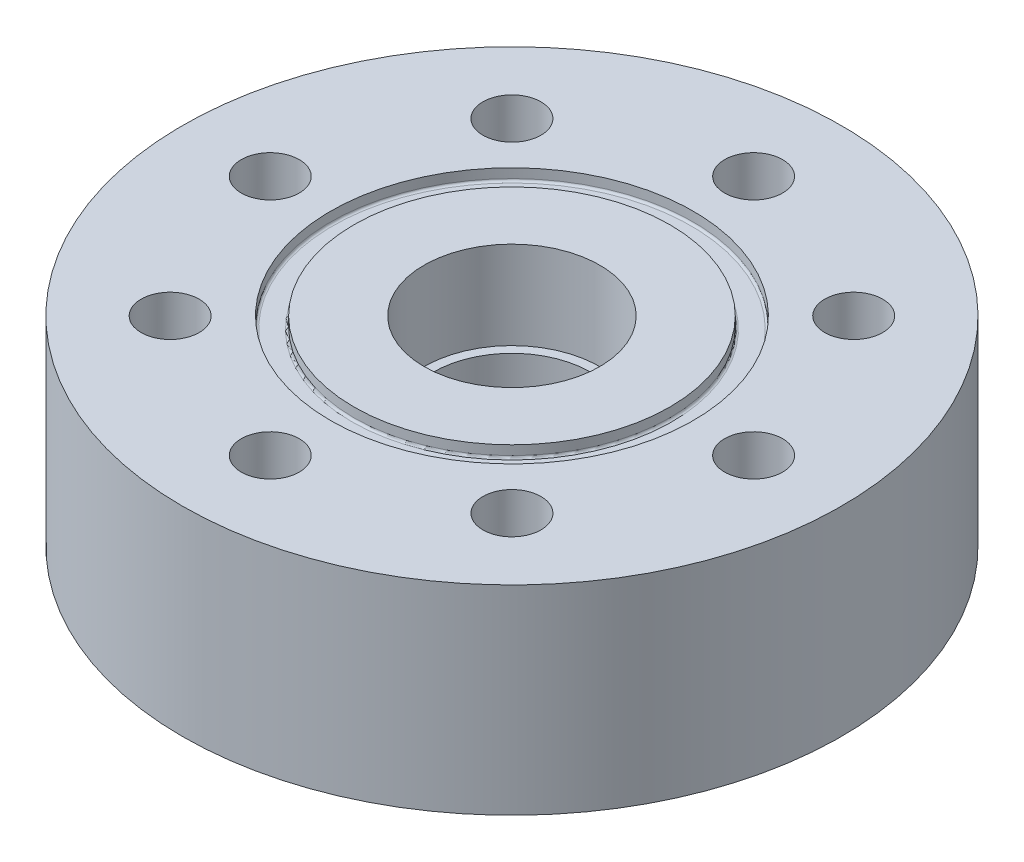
ISO-10303-21;
HEADER;
FILE_DESCRIPTION(('STEP AP214'),'2;1');
FILE_NAME('part.step','',(''),(''),'','','');
FILE_SCHEMA(('AUTOMOTIVE_DESIGN { 1 0 10303 214 1 1 1 1 }'));
ENDSEC;
DATA;
#1=APPLICATION_CONTEXT('core data for automotive mechanical design processes');
#2=APPLICATION_PROTOCOL_DEFINITION('international standard','automotive_design',2000,#1);
#3=PRODUCT_CONTEXT('',#1,'mechanical');
#4=PRODUCT('Part','Part','',(#3));
#5=PRODUCT_RELATED_PRODUCT_CATEGORY('part','',(#4));
#6=PRODUCT_DEFINITION_FORMATION('','',#4);
#7=PRODUCT_DEFINITION_CONTEXT('part definition',#1,'design');
#8=PRODUCT_DEFINITION('design','',#6,#7);
#9=PRODUCT_DEFINITION_SHAPE('','',#8);
#10=(LENGTH_UNIT() NAMED_UNIT(*) SI_UNIT(.MILLI.,.METRE.));
#11=(NAMED_UNIT(*) PLANE_ANGLE_UNIT() SI_UNIT($,.RADIAN.));
#12=(NAMED_UNIT(*) SI_UNIT($,.STERADIAN.) SOLID_ANGLE_UNIT());
#13=UNCERTAINTY_MEASURE_WITH_UNIT(LENGTH_MEASURE(1.E-05),#10,'distance_accuracy_value','');
#14=(GEOMETRIC_REPRESENTATION_CONTEXT(3) GLOBAL_UNCERTAINTY_ASSIGNED_CONTEXT((#13)) GLOBAL_UNIT_ASSIGNED_CONTEXT((#10,
#11,#12)) REPRESENTATION_CONTEXT('',''));
#15=CARTESIAN_POINT('',(0.,0.,0.));
#16=DIRECTION('',(0.,0.,1.));
#17=DIRECTION('',(1.,0.,0.));
#18=AXIS2_PLACEMENT_3D('',#15,#16,#17);
#19=CARTESIAN_POINT('',(0.,22.7,0.));
#20=DIRECTION('',(0.,-1.,0.));
#21=DIRECTION('',(0.,0.,-1.));
#22=AXIS2_PLACEMENT_3D('',#19,#20,#21);
#23=CYLINDRICAL_SURFACE('',#22,37.5);
#24=CARTESIAN_POINT('',(0.,22.7,0.));
#25=DIRECTION('',(0.,1.,0.));
#26=DIRECTION('',(0.,0.,1.));
#27=AXIS2_PLACEMENT_3D('',#24,#25,#26);
#28=CIRCLE('',#27,37.5);
#29=CARTESIAN_POINT('',(0.,22.7,37.5));
#30=VERTEX_POINT('',#29);
#31=EDGE_CURVE('E54',#30,#30,#28,.T.);
#32=ORIENTED_EDGE('',*,*,#31,.F.);
#33=EDGE_LOOP('',(#32));
#34=FACE_BOUND('',#33,.T.);
#35=CARTESIAN_POINT('',(0.,0.,0.));
#36=DIRECTION('',(0.,1.,0.));
#37=DIRECTION('',(0.,0.,1.));
#38=AXIS2_PLACEMENT_3D('',#35,#36,#37);
#39=CIRCLE('',#38,37.5);
#40=CARTESIAN_POINT('',(0.,0.,37.5));
#41=VERTEX_POINT('',#40);
#42=EDGE_CURVE('E55',#41,#41,#39,.T.);
#43=ORIENTED_EDGE('',*,*,#42,.T.);
#44=EDGE_LOOP('',(#43));
#45=FACE_BOUND('',#44,.T.);
#46=ADVANCED_FACE('F34',(#34,#45),#23,.T.);
#47=CARTESIAN_POINT('',(0.,22.7,0.));
#48=DIRECTION('',(0.,1.,0.));
#49=DIRECTION('',(0.,0.,1.));
#50=AXIS2_PLACEMENT_3D('',#47,#48,#49);
#51=PLANE('',#50);
#52=CARTESIAN_POINT('',(0.,22.7,0.));
#53=DIRECTION('',(0.,1.,0.));
#54=DIRECTION('',(0.,0.,1.));
#55=AXIS2_PLACEMENT_3D('',#52,#53,#54);
#56=CIRCLE('',#55,20.6375);
#57=CARTESIAN_POINT('',(0.,22.7,20.6375));
#58=VERTEX_POINT('',#57);
#59=EDGE_CURVE('E73',#58,#58,#56,.T.);
#60=ORIENTED_EDGE('',*,*,#59,.F.);
#61=EDGE_LOOP('',(#60));
#62=FACE_BOUND('',#61,.T.);
#63=CARTESIAN_POINT('',(-27.5,22.7,0.));
#64=DIRECTION('',(0.,-1.,0.));
#65=DIRECTION('',(0.,0.,-1.));
#66=AXIS2_PLACEMENT_3D('',#63,#64,#65);
#67=CIRCLE('',#66,3.3);
#68=CARTESIAN_POINT('',(-27.5,22.7,-3.3));
#69=VERTEX_POINT('',#68);
#70=EDGE_CURVE('E63',#69,#69,#67,.T.);
#71=ORIENTED_EDGE('',*,*,#70,.T.);
#72=EDGE_LOOP('',(#71));
#73=FACE_BOUND('',#72,.T.);
#74=CARTESIAN_POINT('',(-19.44543648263,22.7,19.4454364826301));
#75=DIRECTION('',(0.,-1.,0.));
#76=DIRECTION('',(0.,0.,-1.));
#77=AXIS2_PLACEMENT_3D('',#74,#75,#76);
#78=CIRCLE('',#77,3.30000000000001);
#79=CARTESIAN_POINT('',(-19.44543648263,22.7,16.1454364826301));
#80=VERTEX_POINT('',#79);
#81=EDGE_CURVE('E109',#80,#80,#78,.T.);
#82=ORIENTED_EDGE('',*,*,#81,.T.);
#83=EDGE_LOOP('',(#82));
#84=FACE_BOUND('',#83,.T.);
#85=CARTESIAN_POINT('',(0.,22.7,27.5));
#86=DIRECTION('',(0.,-1.,0.));
#87=DIRECTION('',(0.,0.,-1.));
#88=AXIS2_PLACEMENT_3D('',#85,#86,#87);
#89=CIRCLE('',#88,3.3);
#90=CARTESIAN_POINT('',(0.,22.7,24.2));
#91=VERTEX_POINT('',#90);
#92=EDGE_CURVE('E103',#91,#91,#89,.T.);
#93=ORIENTED_EDGE('',*,*,#92,.T.);
#94=EDGE_LOOP('',(#93));
#95=FACE_BOUND('',#94,.T.);
#96=CARTESIAN_POINT('',(19.4454364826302,22.7,19.44543648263));
#97=DIRECTION('',(0.,-1.,0.));
#98=DIRECTION('',(0.,0.,-1.));
#99=AXIS2_PLACEMENT_3D('',#96,#97,#98);
#100=CIRCLE('',#99,3.3);
#101=CARTESIAN_POINT('',(19.4454364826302,22.7,16.14543648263));
#102=VERTEX_POINT('',#101);
#103=EDGE_CURVE('E97',#102,#102,#100,.T.);
#104=ORIENTED_EDGE('',*,*,#103,.T.);
#105=EDGE_LOOP('',(#104));
#106=FACE_BOUND('',#105,.T.);
#107=CARTESIAN_POINT('',(27.5,22.7,-1.92031473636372E-13));
#108=DIRECTION('',(0.,-1.,0.));
#109=DIRECTION('',(0.,0.,-1.));
#110=AXIS2_PLACEMENT_3D('',#107,#108,#109);
#111=CIRCLE('',#110,3.3);
#112=CARTESIAN_POINT('',(27.5,22.7,-3.30000000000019));
#113=VERTEX_POINT('',#112);
#114=EDGE_CURVE('E91',#113,#113,#111,.T.);
#115=ORIENTED_EDGE('',*,*,#114,.T.);
#116=EDGE_LOOP('',(#115));
#117=FACE_BOUND('',#116,.T.);
#118=CARTESIAN_POINT('',(19.4454364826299,22.7,-19.4454364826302));
#119=DIRECTION('',(0.,-1.,0.));
#120=DIRECTION('',(0.,0.,-1.));
#121=AXIS2_PLACEMENT_3D('',#118,#119,#120);
#122=CIRCLE('',#121,3.3);
#123=CARTESIAN_POINT('',(19.4454364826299,22.7,-22.7454364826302));
#124=VERTEX_POINT('',#123);
#125=EDGE_CURVE('E85',#124,#124,#122,.T.);
#126=ORIENTED_EDGE('',*,*,#125,.T.);
#127=EDGE_LOOP('',(#126));
#128=FACE_BOUND('',#127,.T.);
#129=CARTESIAN_POINT('',(-2.88047210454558E-13,22.7,-27.5));
#130=DIRECTION('',(0.,-1.,0.));
#131=DIRECTION('',(0.,0.,-1.));
#132=AXIS2_PLACEMENT_3D('',#129,#130,#131);
#133=CIRCLE('',#132,3.3);
#134=CARTESIAN_POINT('',(-2.88047210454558E-13,22.7,-30.8));
#135=VERTEX_POINT('',#134);
#136=EDGE_CURVE('E79',#135,#135,#133,.T.);
#137=ORIENTED_EDGE('',*,*,#136,.T.);
#138=EDGE_LOOP('',(#137));
#139=FACE_BOUND('',#138,.T.);
#140=CARTESIAN_POINT('',(-19.4454364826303,22.7,-19.4454364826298));
#141=DIRECTION('',(0.,-1.,0.));
#142=DIRECTION('',(0.,0.,-1.));
#143=AXIS2_PLACEMENT_3D('',#140,#141,#142);
#144=CIRCLE('',#143,3.3);
#145=CARTESIAN_POINT('',(-19.4454364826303,22.7,-22.7454364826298));
#146=VERTEX_POINT('',#145);
#147=EDGE_CURVE('E72',#146,#146,#144,.T.);
#148=ORIENTED_EDGE('',*,*,#147,.T.);
#149=EDGE_LOOP('',(#148));
#150=FACE_BOUND('',#149,.T.);
#151=ORIENTED_EDGE('',*,*,#31,.T.);
#152=EDGE_LOOP('',(#151));
#153=FACE_BOUND('',#152,.T.);
#154=ADVANCED_FACE('F142',(#62,#73,#84,#95,#106,#117,#128,#139,#150,#153),#51,.T.);
#155=CARTESIAN_POINT('',(0.,0.,0.));
#156=DIRECTION('',(0.,1.,0.));
#157=DIRECTION('',(0.,0.,1.));
#158=AXIS2_PLACEMENT_3D('',#155,#156,#157);
#159=PLANE('',#158);
#160=CARTESIAN_POINT('',(-27.5,0.,0.));
#161=DIRECTION('',(0.,-1.,0.));
#162=DIRECTION('',(0.,0.,-1.));
#163=AXIS2_PLACEMENT_3D('',#160,#161,#162);
#164=CIRCLE('',#163,3.3);
#165=CARTESIAN_POINT('',(-27.5,0.,-3.3));
#166=VERTEX_POINT('',#165);
#167=EDGE_CURVE('E112',#166,#166,#164,.T.);
#168=ORIENTED_EDGE('',*,*,#167,.F.);
#169=EDGE_LOOP('',(#168));
#170=FACE_BOUND('',#169,.T.);
#171=CARTESIAN_POINT('',(-19.44543648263,0.,19.4454364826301));
#172=DIRECTION('',(0.,-1.,0.));
#173=DIRECTION('',(0.,0.,-1.));
#174=AXIS2_PLACEMENT_3D('',#171,#172,#173);
#175=CIRCLE('',#174,3.30000000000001);
#176=CARTESIAN_POINT('',(-19.44543648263,0.,16.1454364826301));
#177=VERTEX_POINT('',#176);
#178=EDGE_CURVE('E106',#177,#177,#175,.T.);
#179=ORIENTED_EDGE('',*,*,#178,.F.);
#180=EDGE_LOOP('',(#179));
#181=FACE_BOUND('',#180,.T.);
#182=CARTESIAN_POINT('',(0.,0.,27.5));
#183=DIRECTION('',(0.,-1.,0.));
#184=DIRECTION('',(0.,0.,-1.));
#185=AXIS2_PLACEMENT_3D('',#182,#183,#184);
#186=CIRCLE('',#185,3.3);
#187=CARTESIAN_POINT('',(0.,0.,24.2));
#188=VERTEX_POINT('',#187);
#189=EDGE_CURVE('E100',#188,#188,#186,.T.);
#190=ORIENTED_EDGE('',*,*,#189,.F.);
#191=EDGE_LOOP('',(#190));
#192=FACE_BOUND('',#191,.T.);
#193=CARTESIAN_POINT('',(19.4454364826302,0.,19.44543648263));
#194=DIRECTION('',(0.,-1.,0.));
#195=DIRECTION('',(0.,0.,-1.));
#196=AXIS2_PLACEMENT_3D('',#193,#194,#195);
#197=CIRCLE('',#196,3.3);
#198=CARTESIAN_POINT('',(19.4454364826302,0.,16.14543648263));
#199=VERTEX_POINT('',#198);
#200=EDGE_CURVE('E94',#199,#199,#197,.T.);
#201=ORIENTED_EDGE('',*,*,#200,.F.);
#202=EDGE_LOOP('',(#201));
#203=FACE_BOUND('',#202,.T.);
#204=CARTESIAN_POINT('',(27.5,0.,-1.92031473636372E-13));
#205=DIRECTION('',(0.,-1.,0.));
#206=DIRECTION('',(0.,0.,-1.));
#207=AXIS2_PLACEMENT_3D('',#204,#205,#206);
#208=CIRCLE('',#207,3.3);
#209=CARTESIAN_POINT('',(27.5,0.,-3.30000000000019));
#210=VERTEX_POINT('',#209);
#211=EDGE_CURVE('E88',#210,#210,#208,.T.);
#212=ORIENTED_EDGE('',*,*,#211,.F.);
#213=EDGE_LOOP('',(#212));
#214=FACE_BOUND('',#213,.T.);
#215=CARTESIAN_POINT('',(19.4454364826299,0.,-19.4454364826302));
#216=DIRECTION('',(0.,-1.,0.));
#217=DIRECTION('',(0.,0.,-1.));
#218=AXIS2_PLACEMENT_3D('',#215,#216,#217);
#219=CIRCLE('',#218,3.3);
#220=CARTESIAN_POINT('',(19.4454364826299,0.,-22.7454364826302));
#221=VERTEX_POINT('',#220);
#222=EDGE_CURVE('E82',#221,#221,#219,.T.);
#223=ORIENTED_EDGE('',*,*,#222,.F.);
#224=EDGE_LOOP('',(#223));
#225=FACE_BOUND('',#224,.T.);
#226=CARTESIAN_POINT('',(-2.88047210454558E-13,0.,-27.5));
#227=DIRECTION('',(0.,-1.,0.));
#228=DIRECTION('',(0.,0.,-1.));
#229=AXIS2_PLACEMENT_3D('',#226,#227,#228);
#230=CIRCLE('',#229,3.3);
#231=CARTESIAN_POINT('',(-2.88047210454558E-13,0.,-30.8));
#232=VERTEX_POINT('',#231);
#233=EDGE_CURVE('E76',#232,#232,#230,.T.);
#234=ORIENTED_EDGE('',*,*,#233,.F.);
#235=EDGE_LOOP('',(#234));
#236=FACE_BOUND('',#235,.T.);
#237=CARTESIAN_POINT('',(-19.4454364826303,0.,-19.4454364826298));
#238=DIRECTION('',(0.,-1.,0.));
#239=DIRECTION('',(0.,0.,-1.));
#240=AXIS2_PLACEMENT_3D('',#237,#238,#239);
#241=CIRCLE('',#240,3.3);
#242=CARTESIAN_POINT('',(-19.4454364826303,0.,-22.7454364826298));
#243=VERTEX_POINT('',#242);
#244=EDGE_CURVE('E69',#243,#243,#241,.T.);
#245=ORIENTED_EDGE('',*,*,#244,.F.);
#246=EDGE_LOOP('',(#245));
#247=FACE_BOUND('',#246,.T.);
#248=CARTESIAN_POINT('',(0.,0.,0.));
#249=DIRECTION('',(0.,-1.,0.));
#250=DIRECTION('',(0.,0.,-1.));
#251=AXIS2_PLACEMENT_3D('',#248,#249,#250);
#252=CIRCLE('',#251,8.93);
#253=CARTESIAN_POINT('',(0.,0.,-8.93));
#254=VERTEX_POINT('',#253);
#255=EDGE_CURVE('E58',#254,#254,#252,.T.);
#256=ORIENTED_EDGE('',*,*,#255,.F.);
#257=EDGE_LOOP('',(#256));
#258=FACE_BOUND('',#257,.T.);
#259=ORIENTED_EDGE('',*,*,#42,.F.);
#260=EDGE_LOOP('',(#259));
#261=FACE_BOUND('',#260,.T.);
#262=ADVANCED_FACE('F162',(#170,#181,#192,#203,#214,#225,#236,#247,#258,#261),#159,.F.);
#263=CARTESIAN_POINT('',(0.,12.7,0.));
#264=DIRECTION('',(0.,-1.,0.));
#265=DIRECTION('',(0.,0.,-1.));
#266=AXIS2_PLACEMENT_3D('',#263,#264,#265);
#267=CYLINDRICAL_SURFACE('',#266,8.93);
#268=CARTESIAN_POINT('',(0.,12.7,0.));
#269=DIRECTION('',(0.,-1.,0.));
#270=DIRECTION('',(0.,0.,-1.));
#271=AXIS2_PLACEMENT_3D('',#268,#269,#270);
#272=CIRCLE('',#271,8.93);
#273=CARTESIAN_POINT('',(0.,12.7,-8.93));
#274=VERTEX_POINT('',#273);
#275=EDGE_CURVE('E64',#274,#274,#272,.T.);
#276=ORIENTED_EDGE('',*,*,#275,.F.);
#277=EDGE_LOOP('',(#276));
#278=FACE_BOUND('',#277,.T.);
#279=ORIENTED_EDGE('',*,*,#255,.T.);
#280=EDGE_LOOP('',(#279));
#281=FACE_BOUND('',#280,.T.);
#282=ADVANCED_FACE('F293',(#278,#281),#267,.F.);
#283=CARTESIAN_POINT('',(-19.4454364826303,22.7,-19.4454364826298));
#284=DIRECTION('',(0.,-1.,0.));
#285=DIRECTION('',(0.,0.,-1.));
#286=AXIS2_PLACEMENT_3D('',#283,#284,#285);
#287=CYLINDRICAL_SURFACE('',#286,3.3);
#288=ORIENTED_EDGE('',*,*,#147,.F.);
#289=EDGE_LOOP('',(#288));
#290=FACE_BOUND('',#289,.T.);
#291=ORIENTED_EDGE('',*,*,#244,.T.);
#292=EDGE_LOOP('',(#291));
#293=FACE_BOUND('',#292,.T.);
#294=ADVANCED_FACE('F284',(#290,#293),#287,.F.);
#295=CARTESIAN_POINT('',(-2.88047210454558E-13,22.7,-27.5));
#296=DIRECTION('',(0.,-1.,0.));
#297=DIRECTION('',(0.,0.,-1.));
#298=AXIS2_PLACEMENT_3D('',#295,#296,#297);
#299=CYLINDRICAL_SURFACE('',#298,3.3);
#300=ORIENTED_EDGE('',*,*,#136,.F.);
#301=EDGE_LOOP('',(#300));
#302=FACE_BOUND('',#301,.T.);
#303=ORIENTED_EDGE('',*,*,#233,.T.);
#304=EDGE_LOOP('',(#303));
#305=FACE_BOUND('',#304,.T.);
#306=ADVANCED_FACE('F275',(#302,#305),#299,.F.);
#307=CARTESIAN_POINT('',(19.4454364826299,22.7,-19.4454364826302));
#308=DIRECTION('',(0.,-1.,0.));
#309=DIRECTION('',(0.,0.,-1.));
#310=AXIS2_PLACEMENT_3D('',#307,#308,#309);
#311=CYLINDRICAL_SURFACE('',#310,3.3);
#312=ORIENTED_EDGE('',*,*,#125,.F.);
#313=EDGE_LOOP('',(#312));
#314=FACE_BOUND('',#313,.T.);
#315=ORIENTED_EDGE('',*,*,#222,.T.);
#316=EDGE_LOOP('',(#315));
#317=FACE_BOUND('',#316,.T.);
#318=ADVANCED_FACE('F266',(#314,#317),#311,.F.);
#319=CARTESIAN_POINT('',(27.5,22.7,-1.92031473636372E-13));
#320=DIRECTION('',(0.,-1.,0.));
#321=DIRECTION('',(0.,0.,-1.));
#322=AXIS2_PLACEMENT_3D('',#319,#320,#321);
#323=CYLINDRICAL_SURFACE('',#322,3.3);
#324=ORIENTED_EDGE('',*,*,#114,.F.);
#325=EDGE_LOOP('',(#324));
#326=FACE_BOUND('',#325,.T.);
#327=ORIENTED_EDGE('',*,*,#211,.T.);
#328=EDGE_LOOP('',(#327));
#329=FACE_BOUND('',#328,.T.);
#330=ADVANCED_FACE('F257',(#326,#329),#323,.F.);
#331=CARTESIAN_POINT('',(19.4454364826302,22.7,19.44543648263));
#332=DIRECTION('',(0.,-1.,0.));
#333=DIRECTION('',(0.,0.,-1.));
#334=AXIS2_PLACEMENT_3D('',#331,#332,#333);
#335=CYLINDRICAL_SURFACE('',#334,3.3);
#336=ORIENTED_EDGE('',*,*,#103,.F.);
#337=EDGE_LOOP('',(#336));
#338=FACE_BOUND('',#337,.T.);
#339=ORIENTED_EDGE('',*,*,#200,.T.);
#340=EDGE_LOOP('',(#339));
#341=FACE_BOUND('',#340,.T.);
#342=ADVANCED_FACE('F248',(#338,#341),#335,.F.);
#343=CARTESIAN_POINT('',(0.,22.7,27.5));
#344=DIRECTION('',(0.,-1.,0.));
#345=DIRECTION('',(0.,0.,-1.));
#346=AXIS2_PLACEMENT_3D('',#343,#344,#345);
#347=CYLINDRICAL_SURFACE('',#346,3.3);
#348=ORIENTED_EDGE('',*,*,#92,.F.);
#349=EDGE_LOOP('',(#348));
#350=FACE_BOUND('',#349,.T.);
#351=ORIENTED_EDGE('',*,*,#189,.T.);
#352=EDGE_LOOP('',(#351));
#353=FACE_BOUND('',#352,.T.);
#354=ADVANCED_FACE('F239',(#350,#353),#347,.F.);
#355=CARTESIAN_POINT('',(-19.44543648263,22.7,19.4454364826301));
#356=DIRECTION('',(0.,-1.,0.));
#357=DIRECTION('',(0.,0.,-1.));
#358=AXIS2_PLACEMENT_3D('',#355,#356,#357);
#359=CYLINDRICAL_SURFACE('',#358,3.30000000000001);
#360=ORIENTED_EDGE('',*,*,#81,.F.);
#361=EDGE_LOOP('',(#360));
#362=FACE_BOUND('',#361,.T.);
#363=ORIENTED_EDGE('',*,*,#178,.T.);
#364=EDGE_LOOP('',(#363));
#365=FACE_BOUND('',#364,.T.);
#366=ADVANCED_FACE('F230',(#362,#365),#359,.F.);
#367=CARTESIAN_POINT('',(-27.5,22.7,0.));
#368=DIRECTION('',(0.,-1.,0.));
#369=DIRECTION('',(0.,0.,-1.));
#370=AXIS2_PLACEMENT_3D('',#367,#368,#369);
#371=CYLINDRICAL_SURFACE('',#370,3.3);
#372=ORIENTED_EDGE('',*,*,#70,.F.);
#373=EDGE_LOOP('',(#372));
#374=FACE_BOUND('',#373,.T.);
#375=ORIENTED_EDGE('',*,*,#167,.T.);
#376=EDGE_LOOP('',(#375));
#377=FACE_BOUND('',#376,.T.);
#378=ADVANCED_FACE('F216',(#374,#377),#371,.F.);
#379=CARTESIAN_POINT('',(0.,21.3792,0.));
#380=DIRECTION('',(0.,1.,0.));
#381=DIRECTION('',(0.,0.,1.));
#382=AXIS2_PLACEMENT_3D('',#379,#380,#381);
#383=CYLINDRICAL_SURFACE('',#382,20.6375);
#384=CARTESIAN_POINT('',(0.,21.6332,0.));
#385=DIRECTION('',(0.,1.,0.));
#386=DIRECTION('',(0.,0.,1.));
#387=AXIS2_PLACEMENT_3D('',#384,#385,#386);
#388=CIRCLE('',#387,20.6375);
#389=CARTESIAN_POINT('',(0.,21.6332,20.6375));
#390=VERTEX_POINT('',#389);
#391=EDGE_CURVE('E10',#390,#390,#388,.F.);
#392=ORIENTED_EDGE('',*,*,#391,.T.);
#393=EDGE_LOOP('',(#392));
#394=FACE_BOUND('',#393,.T.);
#395=ORIENTED_EDGE('',*,*,#59,.T.);
#396=EDGE_LOOP('',(#395));
#397=FACE_BOUND('',#396,.T.);
#398=ADVANCED_FACE('F153',(#394,#397),#383,.F.);
#399=CARTESIAN_POINT('',(0.,21.3792,0.));
#400=DIRECTION('',(0.,1.,0.));
#401=DIRECTION('',(0.,0.,1.));
#402=AXIS2_PLACEMENT_3D('',#399,#400,#401);
#403=PLANE('',#402);
#404=CARTESIAN_POINT('',(0.,21.3792,0.));
#405=DIRECTION('',(0.,1.,0.));
#406=DIRECTION('',(0.,0.,1.));
#407=AXIS2_PLACEMENT_3D('',#404,#405,#406);
#408=CIRCLE('',#407,18.2245);
#409=CARTESIAN_POINT('',(0.,21.3792,18.2245));
#410=VERTEX_POINT('',#409);
#411=EDGE_CURVE('E41',#410,#410,#408,.F.);
#412=ORIENTED_EDGE('',*,*,#411,.T.);
#413=EDGE_LOOP('',(#412));
#414=FACE_BOUND('',#413,.T.);
#415=CARTESIAN_POINT('',(0.,21.3792,0.));
#416=DIRECTION('',(0.,1.,0.));
#417=DIRECTION('',(0.,0.,1.));
#418=AXIS2_PLACEMENT_3D('',#415,#416,#417);
#419=CIRCLE('',#418,20.3835);
#420=CARTESIAN_POINT('',(0.,21.3792,20.3835));
#421=VERTEX_POINT('',#420);
#422=EDGE_CURVE('E45',#421,#421,#419,.T.);
#423=ORIENTED_EDGE('',*,*,#422,.T.);
#424=EDGE_LOOP('',(#423));
#425=FACE_BOUND('',#424,.T.);
#426=ADVANCED_FACE('F146',(#414,#425),#403,.T.);
#427=CARTESIAN_POINT('',(0.,21.3792,0.));
#428=DIRECTION('',(0.,1.,0.));
#429=DIRECTION('',(0.,0.,1.));
#430=AXIS2_PLACEMENT_3D('',#427,#428,#429);
#431=CYLINDRICAL_SURFACE('',#430,17.9705);
#432=CARTESIAN_POINT('',(0.,21.6332,0.));
#433=DIRECTION('',(0.,1.,0.));
#434=DIRECTION('',(0.,0.,1.));
#435=AXIS2_PLACEMENT_3D('',#432,#433,#434);
#436=CIRCLE('',#435,17.9705);
#437=CARTESIAN_POINT('',(0.,21.6332,17.9705));
#438=VERTEX_POINT('',#437);
#439=EDGE_CURVE('E49',#438,#438,#436,.T.);
#440=ORIENTED_EDGE('',*,*,#439,.T.);
#441=EDGE_LOOP('',(#440));
#442=FACE_BOUND('',#441,.T.);
#443=CARTESIAN_POINT('',(0.,22.7,0.));
#444=DIRECTION('',(0.,1.,0.));
#445=DIRECTION('',(0.,0.,1.));
#446=AXIS2_PLACEMENT_3D('',#443,#444,#445);
#447=CIRCLE('',#446,17.9705);
#448=CARTESIAN_POINT('',(0.,22.7,17.9705));
#449=VERTEX_POINT('',#448);
#450=EDGE_CURVE('E67',#449,#449,#447,.T.);
#451=ORIENTED_EDGE('',*,*,#450,.F.);
#452=EDGE_LOOP('',(#451));
#453=FACE_BOUND('',#452,.T.);
#454=ADVANCED_FACE('F140',(#442,#453),#431,.T.);
#455=CARTESIAN_POINT('',(0.,22.7,0.));
#456=DIRECTION('',(0.,1.,0.));
#457=DIRECTION('',(0.,0.,1.));
#458=AXIS2_PLACEMENT_3D('',#455,#456,#457);
#459=CIRCLE('',#458,10.);
#460=CARTESIAN_POINT('',(0.,22.7,10.));
#461=VERTEX_POINT('',#460);
#462=EDGE_CURVE('E121',#461,#461,#459,.T.);
#463=ORIENTED_EDGE('',*,*,#462,.F.);
#464=EDGE_LOOP('',(#463));
#465=FACE_BOUND('',#464,.T.);
#466=ORIENTED_EDGE('',*,*,#450,.T.);
#467=EDGE_LOOP('',(#466));
#468=FACE_BOUND('',#467,.T.);
#469=ADVANCED_FACE('F136',(#465,#468),#51,.T.);
#470=CARTESIAN_POINT('',(0.,21.6332,0.));
#471=DIRECTION('',(0.,1.,0.));
#472=DIRECTION('',(0.,0.,1.));
#473=AXIS2_PLACEMENT_3D('',#470,#471,#472);
#474=TOROIDAL_SURFACE('',#473,18.2245,0.254);
#475=ORIENTED_EDGE('',*,*,#411,.F.);
#476=EDGE_LOOP('',(#475));
#477=FACE_BOUND('',#476,.T.);
#478=ORIENTED_EDGE('',*,*,#439,.F.);
#479=EDGE_LOOP('',(#478));
#480=FACE_BOUND('',#479,.T.);
#481=ADVANCED_FACE('F139',(#477,#480),#474,.F.);
#482=CARTESIAN_POINT('',(0.,21.6332,0.));
#483=DIRECTION('',(0.,1.,0.));
#484=DIRECTION('',(0.,0.,1.));
#485=AXIS2_PLACEMENT_3D('',#482,#483,#484);
#486=TOROIDAL_SURFACE('',#485,20.3835,0.254);
#487=ORIENTED_EDGE('',*,*,#391,.F.);
#488=EDGE_LOOP('',(#487));
#489=FACE_BOUND('',#488,.T.);
#490=ORIENTED_EDGE('',*,*,#422,.F.);
#491=EDGE_LOOP('',(#490));
#492=FACE_BOUND('',#491,.T.);
#493=ADVANCED_FACE('F36',(#489,#492),#486,.F.);
#494=CARTESIAN_POINT('',(0.,12.7,0.));
#495=DIRECTION('',(0.,1.,0.));
#496=DIRECTION('',(0.,0.,1.));
#497=AXIS2_PLACEMENT_3D('',#494,#495,#496);
#498=PLANE('',#497);
#499=CARTESIAN_POINT('',(0.,12.7,0.));
#500=DIRECTION('',(0.,1.,0.));
#501=DIRECTION('',(0.,0.,1.));
#502=AXIS2_PLACEMENT_3D('',#499,#500,#501);
#503=CIRCLE('',#502,10.);
#504=CARTESIAN_POINT('',(0.,12.7,10.));
#505=VERTEX_POINT('',#504);
#506=EDGE_CURVE('E68',#505,#505,#503,.T.);
#507=ORIENTED_EDGE('',*,*,#506,.T.);
#508=EDGE_LOOP('',(#507));
#509=FACE_BOUND('',#508,.T.);
#510=ORIENTED_EDGE('',*,*,#275,.T.);
#511=EDGE_LOOP('',(#510));
#512=FACE_BOUND('',#511,.T.);
#513=ADVANCED_FACE('F127',(#509,#512),#498,.T.);
#514=CARTESIAN_POINT('',(0.,12.7,0.));
#515=DIRECTION('',(0.,1.,0.));
#516=DIRECTION('',(0.,0.,1.));
#517=AXIS2_PLACEMENT_3D('',#514,#515,#516);
#518=CYLINDRICAL_SURFACE('',#517,10.);
#519=ORIENTED_EDGE('',*,*,#506,.F.);
#520=EDGE_LOOP('',(#519));
#521=FACE_BOUND('',#520,.T.);
#522=ORIENTED_EDGE('',*,*,#462,.T.);
#523=EDGE_LOOP('',(#522));
#524=FACE_BOUND('',#523,.T.);
#525=ADVANCED_FACE('F130',(#521,#524),#518,.F.);
#526=CLOSED_SHELL('',(#46,#154,#262,#282,#294,#306,#318,#330,#342,#354,#366,#378,#398,#426,#454,
#469,#481,#493,#513,#525));
#527=MANIFOLD_SOLID_BREP('B2',#526);
#528=ADVANCED_BREP_SHAPE_REPRESENTATION('',(#18,#527),#14);
#529=SHAPE_DEFINITION_REPRESENTATION(#9,#528);
ENDSEC;
END-ISO-10303-21;
